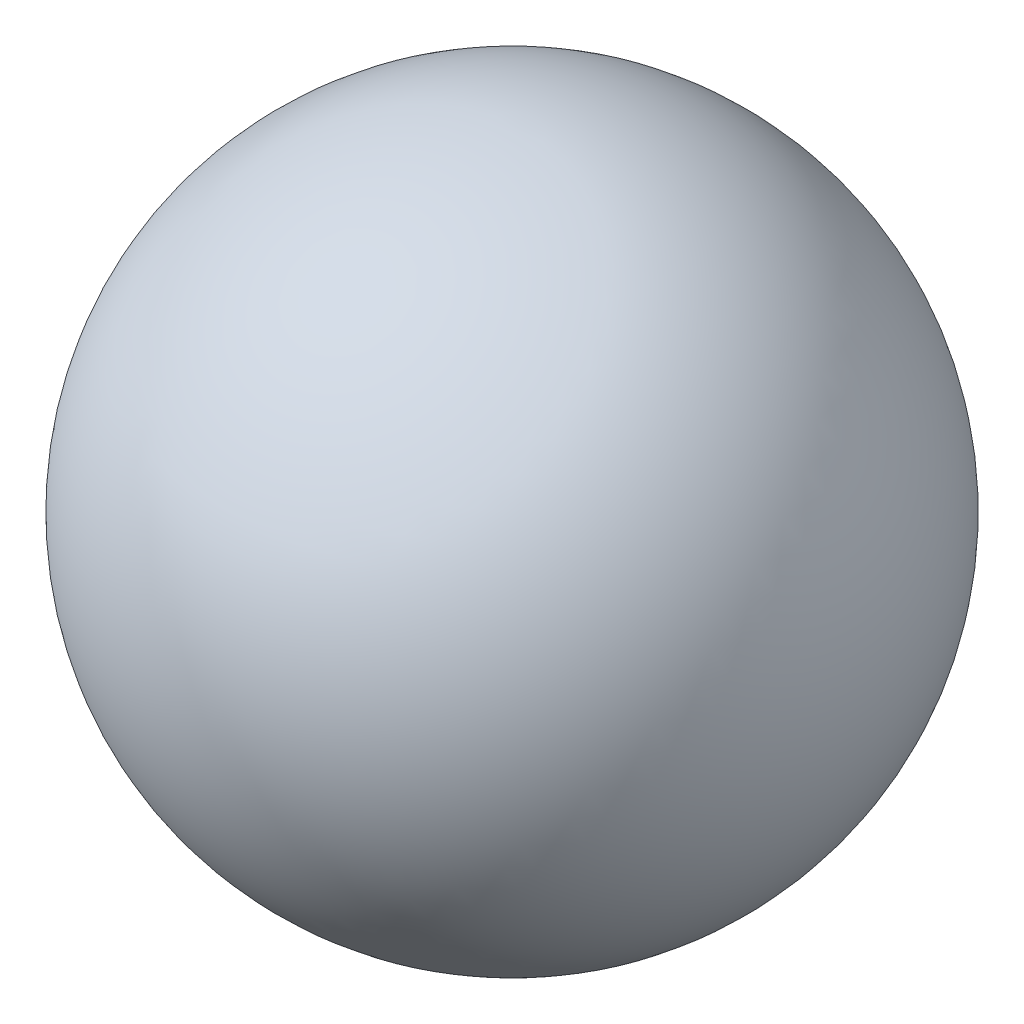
from build123d import *


with BuildPart() as part:
    # Esquisse1 → Base-R_volution (revolve)
    with BuildSketch(Plane(origin=(0, 0, 0), x_dir=(0, 0, -1), z_dir=(1, 0, 0))):
        with BuildLine():
            Line((0, 1.4), (0, -1.4))
            ThreePointArc((0, -1.4), (-1.4, 0), (0, 1.4))
        make_face()
    revolve(axis=Axis((0, 1.4, 0), (0, 1, 0)))


solid = part.part
